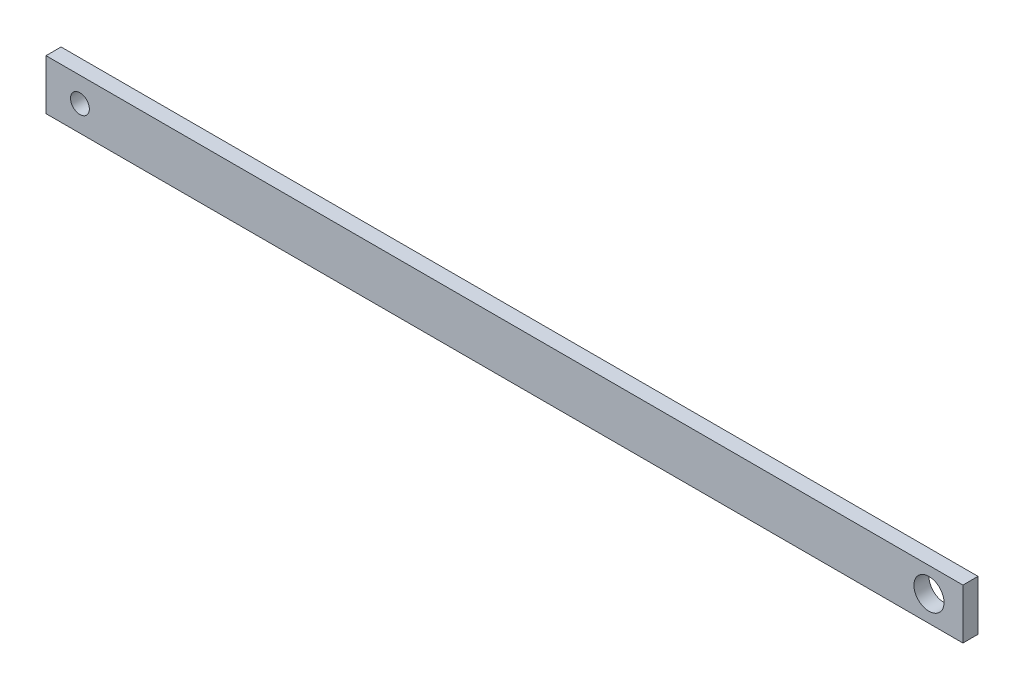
ISO-10303-21;
HEADER;
FILE_DESCRIPTION(('STEP AP214'),'2;1');
FILE_NAME('part.step','',(''),(''),'','','');
FILE_SCHEMA(('AUTOMOTIVE_DESIGN { 1 0 10303 214 1 1 1 1 }'));
ENDSEC;
DATA;
#1=APPLICATION_CONTEXT('core data for automotive mechanical design processes');
#2=APPLICATION_PROTOCOL_DEFINITION('international standard','automotive_design',2000,#1);
#3=PRODUCT_CONTEXT('',#1,'mechanical');
#4=PRODUCT('Part','Part','',(#3));
#5=PRODUCT_RELATED_PRODUCT_CATEGORY('part','',(#4));
#6=PRODUCT_DEFINITION_FORMATION('','',#4);
#7=PRODUCT_DEFINITION_CONTEXT('part definition',#1,'design');
#8=PRODUCT_DEFINITION('design','',#6,#7);
#9=PRODUCT_DEFINITION_SHAPE('','',#8);
#10=(LENGTH_UNIT() NAMED_UNIT(*) SI_UNIT(.MILLI.,.METRE.));
#11=(NAMED_UNIT(*) PLANE_ANGLE_UNIT() SI_UNIT($,.RADIAN.));
#12=(NAMED_UNIT(*) SI_UNIT($,.STERADIAN.) SOLID_ANGLE_UNIT());
#13=UNCERTAINTY_MEASURE_WITH_UNIT(LENGTH_MEASURE(1.E-05),#10,'distance_accuracy_value','');
#14=(GEOMETRIC_REPRESENTATION_CONTEXT(3) GLOBAL_UNCERTAINTY_ASSIGNED_CONTEXT((#13)) GLOBAL_UNIT_ASSIGNED_CONTEXT((#10,
#11,#12)) REPRESENTATION_CONTEXT('',''));
#15=CARTESIAN_POINT('',(0.,0.,0.));
#16=DIRECTION('',(0.,0.,1.));
#17=DIRECTION('',(1.,0.,0.));
#18=AXIS2_PLACEMENT_3D('',#15,#16,#17);
#19=CARTESIAN_POINT('',(0.,0.,2.4));
#20=DIRECTION('',(1.,0.,0.));
#21=DIRECTION('',(0.,0.,-1.));
#22=AXIS2_PLACEMENT_3D('',#19,#20,#21);
#23=PLANE('',#22);
#24=DIRECTION('',(0.,-1.,0.));
#25=VECTOR('',#24,1.);
#26=CARTESIAN_POINT('',(0.,0.,0.));
#27=LINE('',#26,#25);
#28=CARTESIAN_POINT('',(0.,8.,0.));
#29=VERTEX_POINT('',#28);
#30=CARTESIAN_POINT('',(0.,0.,0.));
#31=VERTEX_POINT('',#30);
#32=EDGE_CURVE('E93',#29,#31,#27,.T.);
#33=ORIENTED_EDGE('',*,*,#32,.T.);
#34=DIRECTION('',(0.,0.,-1.));
#35=VECTOR('',#34,1.);
#36=CARTESIAN_POINT('',(0.,0.,2.4));
#37=LINE('',#36,#35);
#38=CARTESIAN_POINT('',(0.,0.,2.4));
#39=VERTEX_POINT('',#38);
#40=EDGE_CURVE('E11',#39,#31,#37,.T.);
#41=ORIENTED_EDGE('',*,*,#40,.F.);
#42=DIRECTION('',(0.,-1.,0.));
#43=VECTOR('',#42,1.);
#44=CARTESIAN_POINT('',(0.,0.,2.4));
#45=LINE('',#44,#43);
#46=CARTESIAN_POINT('',(0.,8.,2.4));
#47=VERTEX_POINT('',#46);
#48=EDGE_CURVE('E81',#47,#39,#45,.T.);
#49=ORIENTED_EDGE('',*,*,#48,.F.);
#50=DIRECTION('',(0.,0.,-1.));
#51=VECTOR('',#50,1.);
#52=CARTESIAN_POINT('',(0.,8.,2.4));
#53=LINE('',#52,#51);
#54=EDGE_CURVE('E89',#47,#29,#53,.T.);
#55=ORIENTED_EDGE('',*,*,#54,.T.);
#56=EDGE_LOOP('',(#33,#41,#49,#55));
#57=FACE_BOUND('',#56,.T.);
#58=ADVANCED_FACE('F30',(#57),#23,.F.);
#59=CARTESIAN_POINT('',(0.,0.,2.4));
#60=DIRECTION('',(0.,1.,0.));
#61=DIRECTION('',(0.,0.,1.));
#62=AXIS2_PLACEMENT_3D('',#59,#60,#61);
#63=PLANE('',#62);
#64=DIRECTION('',(1.,0.,0.));
#65=VECTOR('',#64,1.);
#66=CARTESIAN_POINT('',(0.,0.,0.));
#67=LINE('',#66,#65);
#68=CARTESIAN_POINT('',(146.,0.,0.));
#69=VERTEX_POINT('',#68);
#70=EDGE_CURVE('E85',#31,#69,#67,.T.);
#71=ORIENTED_EDGE('',*,*,#70,.T.);
#72=DIRECTION('',(0.,0.,-1.));
#73=VECTOR('',#72,1.);
#74=CARTESIAN_POINT('',(146.,0.,2.4));
#75=LINE('',#74,#73);
#76=CARTESIAN_POINT('',(146.,0.,2.4));
#77=VERTEX_POINT('',#76);
#78=EDGE_CURVE('E38',#77,#69,#75,.T.);
#79=ORIENTED_EDGE('',*,*,#78,.F.);
#80=DIRECTION('',(1.,0.,0.));
#81=VECTOR('',#80,1.);
#82=CARTESIAN_POINT('',(0.,0.,2.4));
#83=LINE('',#82,#81);
#84=EDGE_CURVE('E76',#39,#77,#83,.T.);
#85=ORIENTED_EDGE('',*,*,#84,.F.);
#86=ORIENTED_EDGE('',*,*,#40,.T.);
#87=EDGE_LOOP('',(#71,#79,#85,#86));
#88=FACE_BOUND('',#87,.T.);
#89=ADVANCED_FACE('F84',(#88),#63,.F.);
#90=CARTESIAN_POINT('',(146.,0.,2.4));
#91=DIRECTION('',(-1.,0.,0.));
#92=DIRECTION('',(0.,0.,1.));
#93=AXIS2_PLACEMENT_3D('',#90,#91,#92);
#94=PLANE('',#93);
#95=DIRECTION('',(0.,1.,0.));
#96=VECTOR('',#95,1.);
#97=CARTESIAN_POINT('',(146.,0.,0.));
#98=LINE('',#97,#96);
#99=CARTESIAN_POINT('',(146.,8.,0.));
#100=VERTEX_POINT('',#99);
#101=EDGE_CURVE('E63',#69,#100,#98,.T.);
#102=ORIENTED_EDGE('',*,*,#101,.T.);
#103=DIRECTION('',(0.,0.,-1.));
#104=VECTOR('',#103,1.);
#105=CARTESIAN_POINT('',(146.,8.,2.4));
#106=LINE('',#105,#104);
#107=CARTESIAN_POINT('',(146.,8.,2.4));
#108=VERTEX_POINT('',#107);
#109=EDGE_CURVE('E86',#108,#100,#106,.T.);
#110=ORIENTED_EDGE('',*,*,#109,.F.);
#111=DIRECTION('',(0.,1.,0.));
#112=VECTOR('',#111,1.);
#113=CARTESIAN_POINT('',(146.,0.,2.4));
#114=LINE('',#113,#112);
#115=EDGE_CURVE('E79',#77,#108,#114,.T.);
#116=ORIENTED_EDGE('',*,*,#115,.F.);
#117=ORIENTED_EDGE('',*,*,#78,.T.);
#118=EDGE_LOOP('',(#102,#110,#116,#117));
#119=FACE_BOUND('',#118,.T.);
#120=ADVANCED_FACE('F87',(#119),#94,.F.);
#121=CARTESIAN_POINT('',(0.,8.,2.4));
#122=DIRECTION('',(0.,-1.,0.));
#123=DIRECTION('',(0.,0.,-1.));
#124=AXIS2_PLACEMENT_3D('',#121,#122,#123);
#125=PLANE('',#124);
#126=DIRECTION('',(-1.,0.,0.));
#127=VECTOR('',#126,1.);
#128=CARTESIAN_POINT('',(0.,8.,0.));
#129=LINE('',#128,#127);
#130=EDGE_CURVE('E69',#100,#29,#129,.T.);
#131=ORIENTED_EDGE('',*,*,#130,.T.);
#132=ORIENTED_EDGE('',*,*,#54,.F.);
#133=DIRECTION('',(-1.,0.,0.));
#134=VECTOR('',#133,1.);
#135=CARTESIAN_POINT('',(0.,8.,2.4));
#136=LINE('',#135,#134);
#137=EDGE_CURVE('E46',#108,#47,#136,.T.);
#138=ORIENTED_EDGE('',*,*,#137,.F.);
#139=ORIENTED_EDGE('',*,*,#109,.T.);
#140=EDGE_LOOP('',(#131,#132,#138,#139));
#141=FACE_BOUND('',#140,.T.);
#142=ADVANCED_FACE('F101',(#141),#125,.F.);
#143=CARTESIAN_POINT('',(0.,8.,2.4));
#144=DIRECTION('',(0.,0.,-1.));
#145=DIRECTION('',(-1.,0.,0.));
#146=AXIS2_PLACEMENT_3D('',#143,#144,#145);
#147=PLANE('',#146);
#148=CARTESIAN_POINT('',(140.595,4.0812742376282,2.4));
#149=DIRECTION('',(0.,0.,1.));
#150=DIRECTION('',(1.,0.,0.));
#151=AXIS2_PLACEMENT_3D('',#148,#149,#150);
#152=CIRCLE('',#151,2.4);
#153=CARTESIAN_POINT('',(142.995,4.0812742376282,2.4));
#154=VERTEX_POINT('',#153);
#155=EDGE_CURVE('E113',#154,#154,#152,.T.);
#156=ORIENTED_EDGE('',*,*,#155,.F.);
#157=EDGE_LOOP('',(#156));
#158=FACE_BOUND('',#157,.T.);
#159=CARTESIAN_POINT('',(5.405,4.0812742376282,2.4));
#160=DIRECTION('',(0.,0.,1.));
#161=DIRECTION('',(1.,0.,0.));
#162=AXIS2_PLACEMENT_3D('',#159,#160,#161);
#163=CIRCLE('',#162,1.5);
#164=CARTESIAN_POINT('',(6.905,4.0812742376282,2.4));
#165=VERTEX_POINT('',#164);
#166=EDGE_CURVE('E107',#165,#165,#163,.T.);
#167=ORIENTED_EDGE('',*,*,#166,.F.);
#168=EDGE_LOOP('',(#167));
#169=FACE_BOUND('',#168,.T.);
#170=ORIENTED_EDGE('',*,*,#48,.T.);
#171=ORIENTED_EDGE('',*,*,#84,.T.);
#172=ORIENTED_EDGE('',*,*,#115,.T.);
#173=ORIENTED_EDGE('',*,*,#137,.T.);
#174=EDGE_LOOP('',(#170,#171,#172,#173));
#175=FACE_BOUND('',#174,.T.);
#176=ADVANCED_FACE('F77',(#158,#169,#175),#147,.F.);
#177=CARTESIAN_POINT('',(0.,8.,0.));
#178=DIRECTION('',(0.,0.,-1.));
#179=DIRECTION('',(-1.,0.,0.));
#180=AXIS2_PLACEMENT_3D('',#177,#178,#179);
#181=PLANE('',#180);
#182=CARTESIAN_POINT('',(140.595,4.0812742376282,0.));
#183=DIRECTION('',(0.,0.,1.));
#184=DIRECTION('',(1.,0.,0.));
#185=AXIS2_PLACEMENT_3D('',#182,#183,#184);
#186=CIRCLE('',#185,2.4);
#187=CARTESIAN_POINT('',(142.995,4.0812742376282,0.));
#188=VERTEX_POINT('',#187);
#189=EDGE_CURVE('E110',#188,#188,#186,.T.);
#190=ORIENTED_EDGE('',*,*,#189,.T.);
#191=EDGE_LOOP('',(#190));
#192=FACE_BOUND('',#191,.T.);
#193=CARTESIAN_POINT('',(5.405,4.0812742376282,0.));
#194=DIRECTION('',(0.,0.,1.));
#195=DIRECTION('',(1.,0.,0.));
#196=AXIS2_PLACEMENT_3D('',#193,#194,#195);
#197=CIRCLE('',#196,1.5);
#198=CARTESIAN_POINT('',(6.905,4.0812742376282,0.));
#199=VERTEX_POINT('',#198);
#200=EDGE_CURVE('E96',#199,#199,#197,.T.);
#201=ORIENTED_EDGE('',*,*,#200,.T.);
#202=EDGE_LOOP('',(#201));
#203=FACE_BOUND('',#202,.T.);
#204=ORIENTED_EDGE('',*,*,#32,.F.);
#205=ORIENTED_EDGE('',*,*,#130,.F.);
#206=ORIENTED_EDGE('',*,*,#101,.F.);
#207=ORIENTED_EDGE('',*,*,#70,.F.);
#208=EDGE_LOOP('',(#204,#205,#206,#207));
#209=FACE_BOUND('',#208,.T.);
#210=ADVANCED_FACE('F104',(#192,#203,#209),#181,.T.);
#211=CARTESIAN_POINT('',(5.405,4.0812742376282,0.));
#212=DIRECTION('',(0.,0.,1.));
#213=DIRECTION('',(1.,0.,0.));
#214=AXIS2_PLACEMENT_3D('',#211,#212,#213);
#215=CYLINDRICAL_SURFACE('',#214,1.5);
#216=ORIENTED_EDGE('',*,*,#200,.F.);
#217=EDGE_LOOP('',(#216));
#218=FACE_BOUND('',#217,.T.);
#219=ORIENTED_EDGE('',*,*,#166,.T.);
#220=EDGE_LOOP('',(#219));
#221=FACE_BOUND('',#220,.T.);
#222=ADVANCED_FACE('F124',(#218,#221),#215,.F.);
#223=CARTESIAN_POINT('',(140.595,4.0812742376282,0.));
#224=DIRECTION('',(0.,0.,1.));
#225=DIRECTION('',(1.,0.,0.));
#226=AXIS2_PLACEMENT_3D('',#223,#224,#225);
#227=CYLINDRICAL_SURFACE('',#226,2.4);
#228=ORIENTED_EDGE('',*,*,#189,.F.);
#229=EDGE_LOOP('',(#228));
#230=FACE_BOUND('',#229,.T.);
#231=ORIENTED_EDGE('',*,*,#155,.T.);
#232=EDGE_LOOP('',(#231));
#233=FACE_BOUND('',#232,.T.);
#234=ADVANCED_FACE('F121',(#230,#233),#227,.F.);
#235=CLOSED_SHELL('',(#58,#89,#120,#142,#176,#210,#222,#234));
#236=MANIFOLD_SOLID_BREP('B2',#235);
#237=ADVANCED_BREP_SHAPE_REPRESENTATION('',(#18,#236),#14);
#238=SHAPE_DEFINITION_REPRESENTATION(#9,#237);
ENDSEC;
END-ISO-10303-21;
